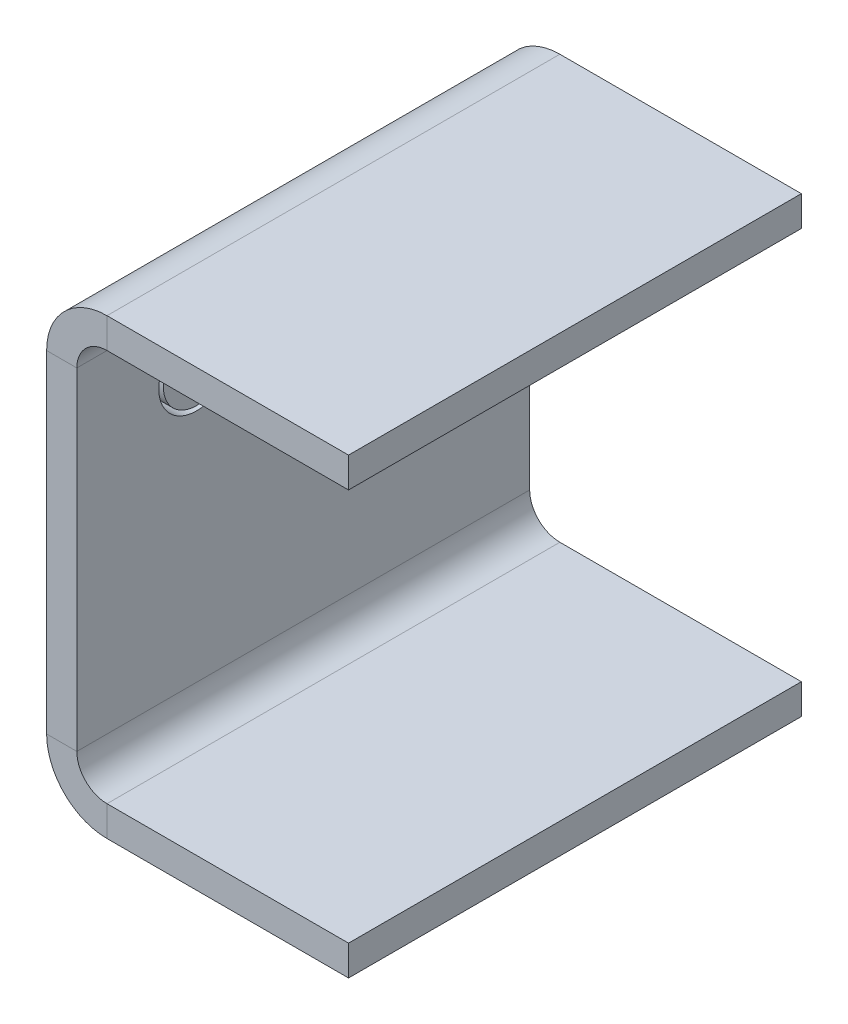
ISO-10303-21;
HEADER;
FILE_DESCRIPTION(('STEP AP214'),'2;1');
FILE_NAME('part.step','',(''),(''),'','','');
FILE_SCHEMA(('AUTOMOTIVE_DESIGN { 1 0 10303 214 1 1 1 1 }'));
ENDSEC;
DATA;
#1=APPLICATION_CONTEXT('core data for automotive mechanical design processes');
#2=APPLICATION_PROTOCOL_DEFINITION('international standard','automotive_design',2000,#1);
#3=PRODUCT_CONTEXT('',#1,'mechanical');
#4=PRODUCT('Part','Part','',(#3));
#5=PRODUCT_RELATED_PRODUCT_CATEGORY('part','',(#4));
#6=PRODUCT_DEFINITION_FORMATION('','',#4);
#7=PRODUCT_DEFINITION_CONTEXT('part definition',#1,'design');
#8=PRODUCT_DEFINITION('design','',#6,#7);
#9=PRODUCT_DEFINITION_SHAPE('','',#8);
#10=(LENGTH_UNIT() NAMED_UNIT(*) SI_UNIT(.MILLI.,.METRE.));
#11=(NAMED_UNIT(*) PLANE_ANGLE_UNIT() SI_UNIT($,.RADIAN.));
#12=(NAMED_UNIT(*) SI_UNIT($,.STERADIAN.) SOLID_ANGLE_UNIT());
#13=UNCERTAINTY_MEASURE_WITH_UNIT(LENGTH_MEASURE(1.E-05),#10,'distance_accuracy_value','');
#14=(GEOMETRIC_REPRESENTATION_CONTEXT(3) GLOBAL_UNCERTAINTY_ASSIGNED_CONTEXT((#13)) GLOBAL_UNIT_ASSIGNED_CONTEXT((#10,
#11,#12)) REPRESENTATION_CONTEXT('',''));
#15=CARTESIAN_POINT('',(0.,0.,0.));
#16=DIRECTION('',(0.,0.,1.));
#17=DIRECTION('',(1.,0.,0.));
#18=AXIS2_PLACEMENT_3D('',#15,#16,#17);
#19=CARTESIAN_POINT('',(4.,15.,15.));
#20=DIRECTION('',(0.,0.,1.));
#21=DIRECTION('',(1.,0.,0.));
#22=AXIS2_PLACEMENT_3D('',#19,#20,#21);
#23=PLANE('',#22);
#24=DIRECTION('',(0.,-1.,0.));
#25=VECTOR('',#24,1.);
#26=CARTESIAN_POINT('',(4.,15.,15.));
#27=LINE('',#26,#25);
#28=CARTESIAN_POINT('',(4.,15.,15.));
#29=VERTEX_POINT('',#28);
#30=CARTESIAN_POINT('',(4.,13.,15.));
#31=VERTEX_POINT('',#30);
#32=EDGE_CURVE('E11',#29,#31,#27,.T.);
#33=ORIENTED_EDGE('',*,*,#32,.F.);
#34=CARTESIAN_POINT('',(4.,11.,15.));
#35=DIRECTION('',(0.,0.,-1.));
#36=DIRECTION('',(-1.,0.,0.));
#37=AXIS2_PLACEMENT_3D('',#34,#35,#36);
#38=CIRCLE('',#37,4.);
#39=CARTESIAN_POINT('',(0.,11.,15.));
#40=VERTEX_POINT('',#39);
#41=EDGE_CURVE('E254',#29,#40,#38,.F.);
#42=ORIENTED_EDGE('',*,*,#41,.T.);
#43=DIRECTION('',(-1.,0.,0.));
#44=VECTOR('',#43,1.);
#45=CARTESIAN_POINT('',(2.,11.,15.));
#46=LINE('',#45,#44);
#47=CARTESIAN_POINT('',(2.,11.,15.));
#48=VERTEX_POINT('',#47);
#49=EDGE_CURVE('E52',#48,#40,#46,.T.);
#50=ORIENTED_EDGE('',*,*,#49,.F.);
#51=CARTESIAN_POINT('',(4.,11.,15.));
#52=DIRECTION('',(0.,0.,1.));
#53=DIRECTION('',(1.,0.,0.));
#54=AXIS2_PLACEMENT_3D('',#51,#52,#53);
#55=CIRCLE('',#54,2.);
#56=EDGE_CURVE('E242',#31,#48,#55,.T.);
#57=ORIENTED_EDGE('',*,*,#56,.F.);
#58=EDGE_LOOP('',(#33,#42,#50,#57));
#59=FACE_BOUND('',#58,.T.);
#60=ADVANCED_FACE('F45',(#59),#23,.T.);
#61=CARTESIAN_POINT('',(2.,11.,15.));
#62=DIRECTION('',(0.,0.,1.));
#63=DIRECTION('',(1.,0.,0.));
#64=AXIS2_PLACEMENT_3D('',#61,#62,#63);
#65=PLANE('',#64);
#66=DIRECTION('',(-1.,0.,0.));
#67=VECTOR('',#66,1.);
#68=CARTESIAN_POINT('',(20.,15.,15.));
#69=LINE('',#68,#67);
#70=CARTESIAN_POINT('',(20.,15.,15.));
#71=VERTEX_POINT('',#70);
#72=EDGE_CURVE('E251',#71,#29,#69,.T.);
#73=ORIENTED_EDGE('',*,*,#72,.T.);
#74=ORIENTED_EDGE('',*,*,#32,.T.);
#75=DIRECTION('',(1.,0.,0.));
#76=VECTOR('',#75,1.);
#77=CARTESIAN_POINT('',(20.,13.,15.));
#78=LINE('',#77,#76);
#79=CARTESIAN_POINT('',(20.,13.,15.));
#80=VERTEX_POINT('',#79);
#81=EDGE_CURVE('E245',#80,#31,#78,.F.);
#82=ORIENTED_EDGE('',*,*,#81,.F.);
#83=DIRECTION('',(0.,-1.,0.));
#84=VECTOR('',#83,1.);
#85=CARTESIAN_POINT('',(20.,15.,15.));
#86=LINE('',#85,#84);
#87=EDGE_CURVE('E248',#71,#80,#86,.T.);
#88=ORIENTED_EDGE('',*,*,#87,.F.);
#89=EDGE_LOOP('',(#73,#74,#82,#88));
#90=FACE_BOUND('',#89,.T.);
#91=ADVANCED_FACE('F347',(#90),#65,.T.);
#92=CARTESIAN_POINT('',(0.,11.,-15.));
#93=DIRECTION('',(0.,0.,-1.));
#94=DIRECTION('',(-1.,0.,0.));
#95=AXIS2_PLACEMENT_3D('',#92,#93,#94);
#96=PLANE('',#95);
#97=DIRECTION('',(1.,0.,0.));
#98=VECTOR('',#97,1.);
#99=CARTESIAN_POINT('',(0.,11.,-15.));
#100=LINE('',#99,#98);
#101=CARTESIAN_POINT('',(0.,11.,-15.));
#102=VERTEX_POINT('',#101);
#103=CARTESIAN_POINT('',(2.,11.,-15.));
#104=VERTEX_POINT('',#103);
#105=EDGE_CURVE('E305',#102,#104,#100,.T.);
#106=ORIENTED_EDGE('',*,*,#105,.F.);
#107=CARTESIAN_POINT('',(4.,11.,-15.));
#108=DIRECTION('',(0.,0.,-1.));
#109=DIRECTION('',(-1.,0.,0.));
#110=AXIS2_PLACEMENT_3D('',#107,#108,#109);
#111=CIRCLE('',#110,4.);
#112=CARTESIAN_POINT('',(4.,15.,-15.));
#113=VERTEX_POINT('',#112);
#114=EDGE_CURVE('E219',#113,#102,#111,.F.);
#115=ORIENTED_EDGE('',*,*,#114,.F.);
#116=DIRECTION('',(0.,1.,0.));
#117=VECTOR('',#116,1.);
#118=CARTESIAN_POINT('',(4.,13.,-15.));
#119=LINE('',#118,#117);
#120=CARTESIAN_POINT('',(4.,13.,-15.));
#121=VERTEX_POINT('',#120);
#122=EDGE_CURVE('E303',#121,#113,#119,.T.);
#123=ORIENTED_EDGE('',*,*,#122,.F.);
#124=CARTESIAN_POINT('',(4.,11.,-15.));
#125=DIRECTION('',(0.,0.,1.));
#126=DIRECTION('',(1.,0.,0.));
#127=AXIS2_PLACEMENT_3D('',#124,#125,#126);
#128=CIRCLE('',#127,2.);
#129=EDGE_CURVE('E207',#121,#104,#128,.T.);
#130=ORIENTED_EDGE('',*,*,#129,.T.);
#131=EDGE_LOOP('',(#106,#115,#123,#130));
#132=FACE_BOUND('',#131,.T.);
#133=ADVANCED_FACE('F357',(#132),#96,.T.);
#134=CARTESIAN_POINT('',(4.,13.,-15.));
#135=DIRECTION('',(0.,0.,-1.));
#136=DIRECTION('',(-1.,0.,0.));
#137=AXIS2_PLACEMENT_3D('',#134,#135,#136);
#138=PLANE('',#137);
#139=DIRECTION('',(0.,-1.,0.));
#140=VECTOR('',#139,1.);
#141=CARTESIAN_POINT('',(0.,15.,-15.));
#142=LINE('',#141,#140);
#143=CARTESIAN_POINT('',(0.,-11.,-15.));
#144=VERTEX_POINT('',#143);
#145=EDGE_CURVE('E222',#102,#144,#142,.T.);
#146=ORIENTED_EDGE('',*,*,#145,.F.);
#147=ORIENTED_EDGE('',*,*,#105,.T.);
#148=DIRECTION('',(0.,1.,0.));
#149=VECTOR('',#148,1.);
#150=CARTESIAN_POINT('',(2.,15.,-15.));
#151=LINE('',#150,#149);
#152=CARTESIAN_POINT('',(2.,-11.,-15.));
#153=VERTEX_POINT('',#152);
#154=EDGE_CURVE('E204',#104,#153,#151,.F.);
#155=ORIENTED_EDGE('',*,*,#154,.T.);
#156=DIRECTION('',(-1.,0.,0.));
#157=VECTOR('',#156,1.);
#158=CARTESIAN_POINT('',(2.,-11.,-15.));
#159=LINE('',#158,#157);
#160=EDGE_CURVE('E295',#153,#144,#159,.T.);
#161=ORIENTED_EDGE('',*,*,#160,.T.);
#162=EDGE_LOOP('',(#146,#147,#155,#161));
#163=FACE_BOUND('',#162,.T.);
#164=ADVANCED_FACE('F359',(#163),#138,.T.);
#165=CARTESIAN_POINT('',(0.,-11.,15.));
#166=DIRECTION('',(0.,0.,1.));
#167=DIRECTION('',(1.,0.,0.));
#168=AXIS2_PLACEMENT_3D('',#165,#166,#167);
#169=PLANE('',#168);
#170=DIRECTION('',(1.,0.,0.));
#171=VECTOR('',#170,1.);
#172=CARTESIAN_POINT('',(0.,-11.,15.));
#173=LINE('',#172,#171);
#174=CARTESIAN_POINT('',(0.,-11.,15.));
#175=VERTEX_POINT('',#174);
#176=CARTESIAN_POINT('',(2.,-11.,15.));
#177=VERTEX_POINT('',#176);
#178=EDGE_CURVE('E301',#175,#177,#173,.T.);
#179=ORIENTED_EDGE('',*,*,#178,.F.);
#180=CARTESIAN_POINT('',(4.,-11.,15.));
#181=DIRECTION('',(0.,0.,-1.));
#182=DIRECTION('',(-1.,0.,0.));
#183=AXIS2_PLACEMENT_3D('',#180,#181,#182);
#184=CIRCLE('',#183,4.);
#185=CARTESIAN_POINT('',(4.,-15.,15.));
#186=VERTEX_POINT('',#185);
#187=EDGE_CURVE('E260',#175,#186,#184,.F.);
#188=ORIENTED_EDGE('',*,*,#187,.T.);
#189=DIRECTION('',(0.,-1.,0.));
#190=VECTOR('',#189,1.);
#191=CARTESIAN_POINT('',(4.,-13.,15.));
#192=LINE('',#191,#190);
#193=CARTESIAN_POINT('',(4.,-13.,15.));
#194=VERTEX_POINT('',#193);
#195=EDGE_CURVE('E299',#194,#186,#192,.T.);
#196=ORIENTED_EDGE('',*,*,#195,.F.);
#197=CARTESIAN_POINT('',(4.,-11.,15.));
#198=DIRECTION('',(0.,0.,1.));
#199=DIRECTION('',(1.,0.,0.));
#200=AXIS2_PLACEMENT_3D('',#197,#198,#199);
#201=CIRCLE('',#200,2.);
#202=EDGE_CURVE('E236',#177,#194,#201,.T.);
#203=ORIENTED_EDGE('',*,*,#202,.F.);
#204=EDGE_LOOP('',(#179,#188,#196,#203));
#205=FACE_BOUND('',#204,.T.);
#206=ADVANCED_FACE('F327',(#205),#169,.T.);
#207=CARTESIAN_POINT('',(4.,-13.,15.));
#208=DIRECTION('',(0.,0.,1.));
#209=DIRECTION('',(1.,0.,0.));
#210=AXIS2_PLACEMENT_3D('',#207,#208,#209);
#211=PLANE('',#210);
#212=DIRECTION('',(0.,-1.,0.));
#213=VECTOR('',#212,1.);
#214=CARTESIAN_POINT('',(0.,15.,15.));
#215=LINE('',#214,#213);
#216=EDGE_CURVE('E257',#40,#175,#215,.T.);
#217=ORIENTED_EDGE('',*,*,#216,.T.);
#218=ORIENTED_EDGE('',*,*,#178,.T.);
#219=DIRECTION('',(0.,1.,0.));
#220=VECTOR('',#219,1.);
#221=CARTESIAN_POINT('',(2.,15.,15.));
#222=LINE('',#221,#220);
#223=EDGE_CURVE('E239',#48,#177,#222,.F.);
#224=ORIENTED_EDGE('',*,*,#223,.F.);
#225=ORIENTED_EDGE('',*,*,#49,.T.);
#226=EDGE_LOOP('',(#217,#218,#224,#225));
#227=FACE_BOUND('',#226,.T.);
#228=ADVANCED_FACE('F308',(#227),#211,.T.);
#229=CARTESIAN_POINT('',(4.,-15.,-15.));
#230=DIRECTION('',(0.,0.,-1.));
#231=DIRECTION('',(-1.,0.,0.));
#232=AXIS2_PLACEMENT_3D('',#229,#230,#231);
#233=PLANE('',#232);
#234=DIRECTION('',(0.,1.,0.));
#235=VECTOR('',#234,1.);
#236=CARTESIAN_POINT('',(4.,-15.,-15.));
#237=LINE('',#236,#235);
#238=CARTESIAN_POINT('',(4.,-15.,-15.));
#239=VERTEX_POINT('',#238);
#240=CARTESIAN_POINT('',(4.,-13.,-15.));
#241=VERTEX_POINT('',#240);
#242=EDGE_CURVE('E297',#239,#241,#237,.T.);
#243=ORIENTED_EDGE('',*,*,#242,.F.);
#244=CARTESIAN_POINT('',(4.,-11.,-15.));
#245=DIRECTION('',(0.,0.,-1.));
#246=DIRECTION('',(-1.,0.,0.));
#247=AXIS2_PLACEMENT_3D('',#244,#245,#246);
#248=CIRCLE('',#247,4.);
#249=EDGE_CURVE('E225',#144,#239,#248,.F.);
#250=ORIENTED_EDGE('',*,*,#249,.F.);
#251=ORIENTED_EDGE('',*,*,#160,.F.);
#252=CARTESIAN_POINT('',(4.,-11.,-15.));
#253=DIRECTION('',(0.,0.,1.));
#254=DIRECTION('',(1.,0.,0.));
#255=AXIS2_PLACEMENT_3D('',#252,#253,#254);
#256=CIRCLE('',#255,2.);
#257=EDGE_CURVE('E201',#153,#241,#256,.T.);
#258=ORIENTED_EDGE('',*,*,#257,.T.);
#259=EDGE_LOOP('',(#243,#250,#251,#258));
#260=FACE_BOUND('',#259,.T.);
#261=ADVANCED_FACE('F361',(#260),#233,.T.);
#262=CARTESIAN_POINT('',(2.,-11.,-15.));
#263=DIRECTION('',(0.,0.,-1.));
#264=DIRECTION('',(-1.,0.,0.));
#265=AXIS2_PLACEMENT_3D('',#262,#263,#264);
#266=PLANE('',#265);
#267=DIRECTION('',(1.,0.,0.));
#268=VECTOR('',#267,1.);
#269=CARTESIAN_POINT('',(0.,-15.,-15.));
#270=LINE('',#269,#268);
#271=CARTESIAN_POINT('',(20.,-15.,-15.));
#272=VERTEX_POINT('',#271);
#273=EDGE_CURVE('E190',#239,#272,#270,.T.);
#274=ORIENTED_EDGE('',*,*,#273,.F.);
#275=ORIENTED_EDGE('',*,*,#242,.T.);
#276=DIRECTION('',(1.,0.,0.));
#277=VECTOR('',#276,1.);
#278=CARTESIAN_POINT('',(0.,-13.,-15.));
#279=LINE('',#278,#277);
#280=CARTESIAN_POINT('',(20.,-13.,-15.));
#281=VERTEX_POINT('',#280);
#282=EDGE_CURVE('E198',#241,#281,#279,.T.);
#283=ORIENTED_EDGE('',*,*,#282,.T.);
#284=DIRECTION('',(0.,-1.,0.));
#285=VECTOR('',#284,1.);
#286=CARTESIAN_POINT('',(20.,-13.,-15.));
#287=LINE('',#286,#285);
#288=EDGE_CURVE('E195',#281,#272,#287,.T.);
#289=ORIENTED_EDGE('',*,*,#288,.T.);
#290=EDGE_LOOP('',(#274,#275,#283,#289));
#291=FACE_BOUND('',#290,.T.);
#292=ADVANCED_FACE('F367',(#291),#266,.T.);
#293=CARTESIAN_POINT('',(0.,-15.,15.));
#294=DIRECTION('',(0.,1.,0.));
#295=DIRECTION('',(0.,0.,1.));
#296=AXIS2_PLACEMENT_3D('',#293,#294,#295);
#297=PLANE('',#296);
#298=ORIENTED_EDGE('',*,*,#273,.T.);
#299=DIRECTION('',(0.,0.,-1.));
#300=VECTOR('',#299,1.);
#301=CARTESIAN_POINT('',(20.,-15.,15.));
#302=LINE('',#301,#300);
#303=CARTESIAN_POINT('',(20.,-15.,15.));
#304=VERTEX_POINT('',#303);
#305=EDGE_CURVE('E293',#304,#272,#302,.T.);
#306=ORIENTED_EDGE('',*,*,#305,.F.);
#307=DIRECTION('',(1.,0.,0.));
#308=VECTOR('',#307,1.);
#309=CARTESIAN_POINT('',(0.,-15.,15.));
#310=LINE('',#309,#308);
#311=EDGE_CURVE('E228',#186,#304,#310,.T.);
#312=ORIENTED_EDGE('',*,*,#311,.F.);
#313=DIRECTION('',(0.,0.,-1.));
#314=VECTOR('',#313,1.);
#315=CARTESIAN_POINT('',(4.,-15.,15.));
#316=LINE('',#315,#314);
#317=EDGE_CURVE('E263',#186,#239,#316,.T.);
#318=ORIENTED_EDGE('',*,*,#317,.T.);
#319=EDGE_LOOP('',(#298,#306,#312,#318));
#320=FACE_BOUND('',#319,.T.);
#321=ADVANCED_FACE('F364',(#320),#297,.F.);
#322=CARTESIAN_POINT('',(20.,-13.,15.));
#323=DIRECTION('',(1.,0.,0.));
#324=DIRECTION('',(0.,0.,-1.));
#325=AXIS2_PLACEMENT_3D('',#322,#323,#324);
#326=PLANE('',#325);
#327=ORIENTED_EDGE('',*,*,#288,.F.);
#328=DIRECTION('',(0.,0.,-1.));
#329=VECTOR('',#328,1.);
#330=CARTESIAN_POINT('',(20.,-13.,15.));
#331=LINE('',#330,#329);
#332=CARTESIAN_POINT('',(20.,-13.,15.));
#333=VERTEX_POINT('',#332);
#334=EDGE_CURVE('E291',#333,#281,#331,.T.);
#335=ORIENTED_EDGE('',*,*,#334,.F.);
#336=DIRECTION('',(0.,-1.,0.));
#337=VECTOR('',#336,1.);
#338=CARTESIAN_POINT('',(20.,-13.,15.));
#339=LINE('',#338,#337);
#340=EDGE_CURVE('E230',#333,#304,#339,.T.);
#341=ORIENTED_EDGE('',*,*,#340,.T.);
#342=ORIENTED_EDGE('',*,*,#305,.T.);
#343=EDGE_LOOP('',(#327,#335,#341,#342));
#344=FACE_BOUND('',#343,.T.);
#345=ADVANCED_FACE('F371',(#344),#326,.T.);
#346=CARTESIAN_POINT('',(0.,-13.,15.));
#347=DIRECTION('',(0.,1.,0.));
#348=DIRECTION('',(0.,0.,1.));
#349=AXIS2_PLACEMENT_3D('',#346,#347,#348);
#350=PLANE('',#349);
#351=ORIENTED_EDGE('',*,*,#282,.F.);
#352=DIRECTION('',(0.,0.,-1.));
#353=VECTOR('',#352,1.);
#354=CARTESIAN_POINT('',(4.,-13.,15.));
#355=LINE('',#354,#353);
#356=EDGE_CURVE('E288',#194,#241,#355,.T.);
#357=ORIENTED_EDGE('',*,*,#356,.F.);
#358=DIRECTION('',(1.,0.,0.));
#359=VECTOR('',#358,1.);
#360=CARTESIAN_POINT('',(0.,-13.,15.));
#361=LINE('',#360,#359);
#362=EDGE_CURVE('E233',#194,#333,#361,.T.);
#363=ORIENTED_EDGE('',*,*,#362,.T.);
#364=ORIENTED_EDGE('',*,*,#334,.T.);
#365=EDGE_LOOP('',(#351,#357,#363,#364));
#366=FACE_BOUND('',#365,.T.);
#367=ADVANCED_FACE('F377',(#366),#350,.T.);
#368=CARTESIAN_POINT('',(4.,-11.,15.));
#369=DIRECTION('',(0.,0.,-1.));
#370=DIRECTION('',(-1.,0.,0.));
#371=AXIS2_PLACEMENT_3D('',#368,#369,#370);
#372=CYLINDRICAL_SURFACE('',#371,2.);
#373=ORIENTED_EDGE('',*,*,#257,.F.);
#374=DIRECTION('',(0.,0.,-1.));
#375=VECTOR('',#374,1.);
#376=CARTESIAN_POINT('',(2.,-11.,15.));
#377=LINE('',#376,#375);
#378=EDGE_CURVE('E285',#177,#153,#377,.T.);
#379=ORIENTED_EDGE('',*,*,#378,.F.);
#380=ORIENTED_EDGE('',*,*,#202,.T.);
#381=ORIENTED_EDGE('',*,*,#356,.T.);
#382=EDGE_LOOP('',(#373,#379,#380,#381));
#383=FACE_BOUND('',#382,.T.);
#384=ADVANCED_FACE('F333',(#383),#372,.F.);
#385=CARTESIAN_POINT('',(2.,15.,15.));
#386=DIRECTION('',(1.,0.,0.));
#387=DIRECTION('',(0.,0.,-1.));
#388=AXIS2_PLACEMENT_3D('',#385,#386,#387);
#389=PLANE('',#388);
#390=CARTESIAN_POINT('',(2.,7.07106781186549,7.07106781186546));
#391=DIRECTION('',(-1.,0.,0.));
#392=DIRECTION('',(0.,0.,-1.));
#393=AXIS2_PLACEMENT_3D('',#390,#391,#392);
#394=CIRCLE('',#393,2.5);
#395=CARTESIAN_POINT('',(2.,6.21601745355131,4.72183625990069));
#396=VERTEX_POINT('',#395);
#397=CARTESIAN_POINT('',(2.,7.07106781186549,4.57106781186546));
#398=VERTEX_POINT('',#397);
#399=EDGE_CURVE('E176',#396,#398,#394,.T.);
#400=ORIENTED_EDGE('',*,*,#399,.T.);
#401=DIRECTION('',(0.,0.,1.));
#402=VECTOR('',#401,1.);
#403=CARTESIAN_POINT('',(2.,7.07106781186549,4.57106781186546));
#404=LINE('',#403,#402);
#405=CARTESIAN_POINT('',(2.,7.07106781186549,4.87106781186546));
#406=VERTEX_POINT('',#405);
#407=EDGE_CURVE('E182',#398,#406,#404,.T.);
#408=ORIENTED_EDGE('',*,*,#407,.T.);
#409=CARTESIAN_POINT('',(2.,7.07106781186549,7.07106781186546));
#410=DIRECTION('',(1.,0.,0.));
#411=DIRECTION('',(0.,0.,-1.));
#412=AXIS2_PLACEMENT_3D('',#409,#410,#411);
#413=CIRCLE('',#412,2.2);
#414=CARTESIAN_POINT('',(2.,6.31862349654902,5.00374404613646));
#415=VERTEX_POINT('',#414);
#416=EDGE_CURVE('E59',#406,#415,#413,.T.);
#417=ORIENTED_EDGE('',*,*,#416,.T.);
#418=DIRECTION('',(0.,-0.342020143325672,-0.939692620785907));
#419=VECTOR('',#418,1.);
#420=CARTESIAN_POINT('',(2.,6.21601745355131,4.72183625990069));
#421=LINE('',#420,#419);
#422=EDGE_CURVE('E185',#415,#396,#421,.T.);
#423=ORIENTED_EDGE('',*,*,#422,.T.);
#424=EDGE_LOOP('',(#400,#408,#417,#423));
#425=FACE_BOUND('',#424,.T.);
#426=ORIENTED_EDGE('',*,*,#154,.F.);
#427=DIRECTION('',(0.,0.,-1.));
#428=VECTOR('',#427,1.);
#429=CARTESIAN_POINT('',(2.,11.,15.));
#430=LINE('',#429,#428);
#431=EDGE_CURVE('E282',#48,#104,#430,.T.);
#432=ORIENTED_EDGE('',*,*,#431,.F.);
#433=ORIENTED_EDGE('',*,*,#223,.T.);
#434=ORIENTED_EDGE('',*,*,#378,.T.);
#435=EDGE_LOOP('',(#426,#432,#433,#434));
#436=FACE_BOUND('',#435,.T.);
#437=ADVANCED_FACE('F336',(#425,#436),#389,.T.);
#438=CARTESIAN_POINT('',(4.,11.,15.));
#439=DIRECTION('',(0.,0.,-1.));
#440=DIRECTION('',(-1.,0.,0.));
#441=AXIS2_PLACEMENT_3D('',#438,#439,#440);
#442=CYLINDRICAL_SURFACE('',#441,2.);
#443=ORIENTED_EDGE('',*,*,#129,.F.);
#444=DIRECTION('',(0.,0.,-1.));
#445=VECTOR('',#444,1.);
#446=CARTESIAN_POINT('',(4.,13.,15.));
#447=LINE('',#446,#445);
#448=EDGE_CURVE('E279',#31,#121,#447,.T.);
#449=ORIENTED_EDGE('',*,*,#448,.F.);
#450=ORIENTED_EDGE('',*,*,#56,.T.);
#451=ORIENTED_EDGE('',*,*,#431,.T.);
#452=EDGE_LOOP('',(#443,#449,#450,#451));
#453=FACE_BOUND('',#452,.T.);
#454=ADVANCED_FACE('F339',(#453),#442,.F.);
#455=CARTESIAN_POINT('',(20.,13.,15.));
#456=DIRECTION('',(0.,-1.,0.));
#457=DIRECTION('',(0.,0.,-1.));
#458=AXIS2_PLACEMENT_3D('',#455,#456,#457);
#459=PLANE('',#458);
#460=DIRECTION('',(1.,0.,0.));
#461=VECTOR('',#460,1.);
#462=CARTESIAN_POINT('',(20.,13.,-15.));
#463=LINE('',#462,#461);
#464=CARTESIAN_POINT('',(20.,13.,-15.));
#465=VERTEX_POINT('',#464);
#466=EDGE_CURVE('E210',#465,#121,#463,.F.);
#467=ORIENTED_EDGE('',*,*,#466,.F.);
#468=DIRECTION('',(0.,0.,-1.));
#469=VECTOR('',#468,1.);
#470=CARTESIAN_POINT('',(20.,13.,15.));
#471=LINE('',#470,#469);
#472=EDGE_CURVE('E277',#80,#465,#471,.T.);
#473=ORIENTED_EDGE('',*,*,#472,.F.);
#474=ORIENTED_EDGE('',*,*,#81,.T.);
#475=ORIENTED_EDGE('',*,*,#448,.T.);
#476=EDGE_LOOP('',(#467,#473,#474,#475));
#477=FACE_BOUND('',#476,.T.);
#478=ADVANCED_FACE('F344',(#477),#459,.T.);
#479=CARTESIAN_POINT('',(20.,15.,15.));
#480=DIRECTION('',(1.,0.,0.));
#481=DIRECTION('',(0.,0.,-1.));
#482=AXIS2_PLACEMENT_3D('',#479,#480,#481);
#483=PLANE('',#482);
#484=DIRECTION('',(0.,-1.,0.));
#485=VECTOR('',#484,1.);
#486=CARTESIAN_POINT('',(20.,15.,-15.));
#487=LINE('',#486,#485);
#488=CARTESIAN_POINT('',(20.,15.,-15.));
#489=VERTEX_POINT('',#488);
#490=EDGE_CURVE('E213',#489,#465,#487,.T.);
#491=ORIENTED_EDGE('',*,*,#490,.F.);
#492=DIRECTION('',(0.,0.,-1.));
#493=VECTOR('',#492,1.);
#494=CARTESIAN_POINT('',(20.,15.,15.));
#495=LINE('',#494,#493);
#496=EDGE_CURVE('E275',#71,#489,#495,.T.);
#497=ORIENTED_EDGE('',*,*,#496,.F.);
#498=ORIENTED_EDGE('',*,*,#87,.T.);
#499=ORIENTED_EDGE('',*,*,#472,.T.);
#500=EDGE_LOOP('',(#491,#497,#498,#499));
#501=FACE_BOUND('',#500,.T.);
#502=ADVANCED_FACE('F350',(#501),#483,.T.);
#503=CARTESIAN_POINT('',(20.,15.,15.));
#504=DIRECTION('',(0.,-1.,0.));
#505=DIRECTION('',(0.,0.,-1.));
#506=AXIS2_PLACEMENT_3D('',#503,#504,#505);
#507=PLANE('',#506);
#508=DIRECTION('',(-1.,0.,0.));
#509=VECTOR('',#508,1.);
#510=CARTESIAN_POINT('',(20.,15.,-15.));
#511=LINE('',#510,#509);
#512=EDGE_CURVE('E216',#489,#113,#511,.T.);
#513=ORIENTED_EDGE('',*,*,#512,.T.);
#514=DIRECTION('',(0.,0.,-1.));
#515=VECTOR('',#514,1.);
#516=CARTESIAN_POINT('',(4.,15.,15.));
#517=LINE('',#516,#515);
#518=EDGE_CURVE('E272',#29,#113,#517,.T.);
#519=ORIENTED_EDGE('',*,*,#518,.F.);
#520=ORIENTED_EDGE('',*,*,#72,.F.);
#521=ORIENTED_EDGE('',*,*,#496,.T.);
#522=EDGE_LOOP('',(#513,#519,#520,#521));
#523=FACE_BOUND('',#522,.T.);
#524=ADVANCED_FACE('F355',(#523),#507,.F.);
#525=CARTESIAN_POINT('',(4.,11.,15.));
#526=DIRECTION('',(0.,0.,-1.));
#527=DIRECTION('',(-1.,0.,0.));
#528=AXIS2_PLACEMENT_3D('',#525,#526,#527);
#529=CYLINDRICAL_SURFACE('',#528,4.);
#530=ORIENTED_EDGE('',*,*,#114,.T.);
#531=DIRECTION('',(0.,0.,-1.));
#532=VECTOR('',#531,1.);
#533=CARTESIAN_POINT('',(0.,11.,15.));
#534=LINE('',#533,#532);
#535=EDGE_CURVE('E269',#40,#102,#534,.T.);
#536=ORIENTED_EDGE('',*,*,#535,.F.);
#537=ORIENTED_EDGE('',*,*,#41,.F.);
#538=ORIENTED_EDGE('',*,*,#518,.T.);
#539=EDGE_LOOP('',(#530,#536,#537,#538));
#540=FACE_BOUND('',#539,.T.);
#541=ADVANCED_FACE('F317',(#540),#529,.T.);
#542=CARTESIAN_POINT('',(0.,15.,15.));
#543=DIRECTION('',(1.,0.,0.));
#544=DIRECTION('',(0.,0.,-1.));
#545=AXIS2_PLACEMENT_3D('',#542,#543,#544);
#546=PLANE('',#545);
#547=DIRECTION('',(0.,0.,1.));
#548=VECTOR('',#547,1.);
#549=CARTESIAN_POINT('',(0.,7.07106781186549,4.57106781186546));
#550=LINE('',#549,#548);
#551=CARTESIAN_POINT('',(0.,7.07106781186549,4.57106781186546));
#552=VERTEX_POINT('',#551);
#553=CARTESIAN_POINT('',(0.,7.07106781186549,4.87106781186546));
#554=VERTEX_POINT('',#553);
#555=EDGE_CURVE('E167',#552,#554,#550,.T.);
#556=ORIENTED_EDGE('',*,*,#555,.F.);
#557=CARTESIAN_POINT('',(0.,7.07106781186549,7.07106781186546));
#558=DIRECTION('',(-1.,0.,0.));
#559=DIRECTION('',(0.,0.,-1.));
#560=AXIS2_PLACEMENT_3D('',#557,#558,#559);
#561=CIRCLE('',#560,2.5);
#562=CARTESIAN_POINT('',(0.,6.21601745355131,4.72183625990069));
#563=VERTEX_POINT('',#562);
#564=EDGE_CURVE('E67',#563,#552,#561,.T.);
#565=ORIENTED_EDGE('',*,*,#564,.F.);
#566=DIRECTION('',(0.,-0.342020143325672,-0.939692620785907));
#567=VECTOR('',#566,1.);
#568=CARTESIAN_POINT('',(0.,6.21601745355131,4.72183625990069));
#569=LINE('',#568,#567);
#570=CARTESIAN_POINT('',(0.,6.31862349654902,5.00374404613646));
#571=VERTEX_POINT('',#570);
#572=EDGE_CURVE('E174',#571,#563,#569,.T.);
#573=ORIENTED_EDGE('',*,*,#572,.F.);
#574=CARTESIAN_POINT('',(0.,7.07106781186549,7.07106781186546));
#575=DIRECTION('',(1.,0.,0.));
#576=DIRECTION('',(0.,0.,-1.));
#577=AXIS2_PLACEMENT_3D('',#574,#575,#576);
#578=CIRCLE('',#577,2.2);
#579=EDGE_CURVE('E158',#554,#571,#578,.T.);
#580=ORIENTED_EDGE('',*,*,#579,.F.);
#581=EDGE_LOOP('',(#556,#565,#573,#580));
#582=FACE_BOUND('',#581,.T.);
#583=ORIENTED_EDGE('',*,*,#145,.T.);
#584=DIRECTION('',(0.,0.,-1.));
#585=VECTOR('',#584,1.);
#586=CARTESIAN_POINT('',(0.,-11.,15.));
#587=LINE('',#586,#585);
#588=EDGE_CURVE('E266',#175,#144,#587,.T.);
#589=ORIENTED_EDGE('',*,*,#588,.F.);
#590=ORIENTED_EDGE('',*,*,#216,.F.);
#591=ORIENTED_EDGE('',*,*,#535,.T.);
#592=EDGE_LOOP('',(#583,#589,#590,#591));
#593=FACE_BOUND('',#592,.T.);
#594=ADVANCED_FACE('F171',(#582,#593),#546,.F.);
#595=CARTESIAN_POINT('',(4.,-11.,15.));
#596=DIRECTION('',(0.,0.,-1.));
#597=DIRECTION('',(-1.,0.,0.));
#598=AXIS2_PLACEMENT_3D('',#595,#596,#597);
#599=CYLINDRICAL_SURFACE('',#598,4.);
#600=ORIENTED_EDGE('',*,*,#249,.T.);
#601=ORIENTED_EDGE('',*,*,#317,.F.);
#602=ORIENTED_EDGE('',*,*,#187,.F.);
#603=ORIENTED_EDGE('',*,*,#588,.T.);
#604=EDGE_LOOP('',(#600,#601,#602,#603));
#605=FACE_BOUND('',#604,.T.);
#606=ADVANCED_FACE('F324',(#605),#599,.T.);
#607=CARTESIAN_POINT('',(4.,-11.,15.));
#608=DIRECTION('',(0.,0.,1.));
#609=DIRECTION('',(1.,0.,0.));
#610=AXIS2_PLACEMENT_3D('',#607,#608,#609);
#611=PLANE('',#610);
#612=ORIENTED_EDGE('',*,*,#311,.T.);
#613=ORIENTED_EDGE('',*,*,#340,.F.);
#614=ORIENTED_EDGE('',*,*,#362,.F.);
#615=ORIENTED_EDGE('',*,*,#195,.T.);
#616=EDGE_LOOP('',(#612,#613,#614,#615));
#617=FACE_BOUND('',#616,.T.);
#618=ADVANCED_FACE('F375',(#617),#611,.T.);
#619=CARTESIAN_POINT('',(4.,-11.,-15.));
#620=DIRECTION('',(0.,0.,1.));
#621=DIRECTION('',(1.,0.,0.));
#622=AXIS2_PLACEMENT_3D('',#619,#620,#621);
#623=PLANE('',#622);
#624=ORIENTED_EDGE('',*,*,#466,.T.);
#625=ORIENTED_EDGE('',*,*,#122,.T.);
#626=ORIENTED_EDGE('',*,*,#512,.F.);
#627=ORIENTED_EDGE('',*,*,#490,.T.);
#628=EDGE_LOOP('',(#624,#625,#626,#627));
#629=FACE_BOUND('',#628,.T.);
#630=ADVANCED_FACE('F506',(#629),#623,.F.);
#631=CARTESIAN_POINT('',(2.,7.07106781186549,7.07106781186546));
#632=DIRECTION('',(-1.,0.,0.));
#633=DIRECTION('',(0.,0.,1.));
#634=AXIS2_PLACEMENT_3D('',#631,#632,#633);
#635=CYLINDRICAL_SURFACE('',#634,2.5);
#636=ORIENTED_EDGE('',*,*,#564,.T.);
#637=DIRECTION('',(-1.,0.,0.));
#638=VECTOR('',#637,1.);
#639=CARTESIAN_POINT('',(2.,7.07106781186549,4.57106781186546));
#640=LINE('',#639,#638);
#641=EDGE_CURVE('E164',#398,#552,#640,.T.);
#642=ORIENTED_EDGE('',*,*,#641,.F.);
#643=ORIENTED_EDGE('',*,*,#399,.F.);
#644=DIRECTION('',(-1.,0.,0.));
#645=VECTOR('',#644,1.);
#646=CARTESIAN_POINT('',(2.,6.21601745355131,4.72183625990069));
#647=LINE('',#646,#645);
#648=EDGE_CURVE('E188',#396,#563,#647,.T.);
#649=ORIENTED_EDGE('',*,*,#648,.T.);
#650=EDGE_LOOP('',(#636,#642,#643,#649));
#651=FACE_BOUND('',#650,.T.);
#652=ADVANCED_FACE('F513',(#651),#635,.F.);
#653=CARTESIAN_POINT('',(2.,6.21601745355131,4.72183625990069));
#654=DIRECTION('',(0.,0.939692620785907,-0.342020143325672));
#655=DIRECTION('',(0.,0.342020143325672,0.939692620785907));
#656=AXIS2_PLACEMENT_3D('',#653,#654,#655);
#657=PLANE('',#656);
#658=ORIENTED_EDGE('',*,*,#572,.T.);
#659=ORIENTED_EDGE('',*,*,#648,.F.);
#660=ORIENTED_EDGE('',*,*,#422,.F.);
#661=DIRECTION('',(-1.,0.,0.));
#662=VECTOR('',#661,1.);
#663=CARTESIAN_POINT('',(2.,6.31862349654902,5.00374404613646));
#664=LINE('',#663,#662);
#665=EDGE_CURVE('E163',#415,#571,#664,.T.);
#666=ORIENTED_EDGE('',*,*,#665,.T.);
#667=EDGE_LOOP('',(#658,#659,#660,#666));
#668=FACE_BOUND('',#667,.T.);
#669=ADVANCED_FACE('F522',(#668),#657,.F.);
#670=CARTESIAN_POINT('',(2.,7.07106781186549,7.07106781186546));
#671=DIRECTION('',(-1.,0.,0.));
#672=DIRECTION('',(0.,0.,1.));
#673=AXIS2_PLACEMENT_3D('',#670,#671,#672);
#674=CYLINDRICAL_SURFACE('',#673,2.2);
#675=ORIENTED_EDGE('',*,*,#579,.T.);
#676=ORIENTED_EDGE('',*,*,#665,.F.);
#677=ORIENTED_EDGE('',*,*,#416,.F.);
#678=DIRECTION('',(-1.,0.,0.));
#679=VECTOR('',#678,1.);
#680=CARTESIAN_POINT('',(2.,7.07106781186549,4.87106781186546));
#681=LINE('',#680,#679);
#682=EDGE_CURVE('E154',#406,#554,#681,.T.);
#683=ORIENTED_EDGE('',*,*,#682,.T.);
#684=EDGE_LOOP('',(#675,#676,#677,#683));
#685=FACE_BOUND('',#684,.T.);
#686=ADVANCED_FACE('F156',(#685),#674,.T.);
#687=CARTESIAN_POINT('',(2.,7.07106781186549,4.57106781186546));
#688=DIRECTION('',(0.,-1.,0.));
#689=DIRECTION('',(0.,0.,-1.));
#690=AXIS2_PLACEMENT_3D('',#687,#688,#689);
#691=PLANE('',#690);
#692=ORIENTED_EDGE('',*,*,#555,.T.);
#693=ORIENTED_EDGE('',*,*,#682,.F.);
#694=ORIENTED_EDGE('',*,*,#407,.F.);
#695=ORIENTED_EDGE('',*,*,#641,.T.);
#696=EDGE_LOOP('',(#692,#693,#694,#695));
#697=FACE_BOUND('',#696,.T.);
#698=ADVANCED_FACE('F168',(#697),#691,.F.);
#699=CLOSED_SHELL('',(#60,#91,#133,#164,#206,#228,#261,#292,#321,#345,#367,#384,#437,#454,#478,
#502,#524,#541,#594,#606,#618,#630,#652,#669,#686,#698));
#700=MANIFOLD_SOLID_BREP('B2',#699);
#701=ADVANCED_BREP_SHAPE_REPRESENTATION('',(#18,#700),#14);
#702=SHAPE_DEFINITION_REPRESENTATION(#9,#701);
ENDSEC;
END-ISO-10303-21;
